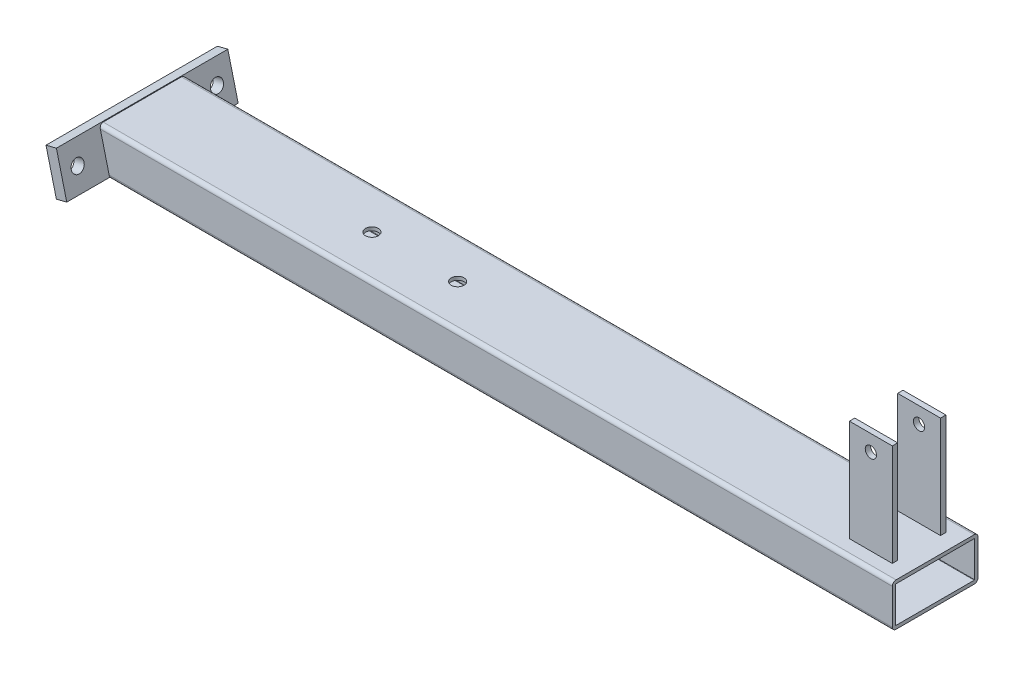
ISO-10303-21;
HEADER;
FILE_DESCRIPTION(('STEP AP214'),'2;1');
FILE_NAME('part.step','',(''),(''),'','','');
FILE_SCHEMA(('AUTOMOTIVE_DESIGN { 1 0 10303 214 1 1 1 1 }'));
ENDSEC;
DATA;
#1=APPLICATION_CONTEXT('core data for automotive mechanical design processes');
#2=APPLICATION_PROTOCOL_DEFINITION('international standard','automotive_design',2000,#1);
#3=PRODUCT_CONTEXT('',#1,'mechanical');
#4=PRODUCT('Part','Part','',(#3));
#5=PRODUCT_RELATED_PRODUCT_CATEGORY('part','',(#4));
#6=PRODUCT_DEFINITION_FORMATION('','',#4);
#7=PRODUCT_DEFINITION_CONTEXT('part definition',#1,'design');
#8=PRODUCT_DEFINITION('design','',#6,#7);
#9=PRODUCT_DEFINITION_SHAPE('','',#8);
#10=(LENGTH_UNIT() NAMED_UNIT(*) SI_UNIT(.MILLI.,.METRE.));
#11=(NAMED_UNIT(*) PLANE_ANGLE_UNIT() SI_UNIT($,.RADIAN.));
#12=(NAMED_UNIT(*) SI_UNIT($,.STERADIAN.) SOLID_ANGLE_UNIT());
#13=UNCERTAINTY_MEASURE_WITH_UNIT(LENGTH_MEASURE(1.E-05),#10,'distance_accuracy_value','');
#14=(GEOMETRIC_REPRESENTATION_CONTEXT(3) GLOBAL_UNCERTAINTY_ASSIGNED_CONTEXT((#13)) GLOBAL_UNIT_ASSIGNED_CONTEXT((#10,
#11,#12)) REPRESENTATION_CONTEXT('',''));
#15=CARTESIAN_POINT('',(0.,0.,0.));
#16=DIRECTION('',(0.,0.,1.));
#17=DIRECTION('',(1.,0.,0.));
#18=AXIS2_PLACEMENT_3D('',#15,#16,#17);
#19=CARTESIAN_POINT('',(-55.,115.,24.9999999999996));
#20=DIRECTION('',(0.,0.,-1.));
#21=DIRECTION('',(0.,1.,0.));
#22=AXIS2_PLACEMENT_3D('',#19,#20,#21);
#23=PLANE('',#22);
#24=CARTESIAN_POINT('',(-35.,99.9999999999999,24.9999999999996));
#25=DIRECTION('',(0.,0.,-1.));
#26=DIRECTION('',(0.,1.,0.));
#27=AXIS2_PLACEMENT_3D('',#24,#25,#26);
#28=CIRCLE('',#27,5.25);
#29=CARTESIAN_POINT('',(-35.,105.25,24.9999999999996));
#30=VERTEX_POINT('',#29);
#31=EDGE_CURVE('E137',#30,#30,#28,.T.);
#32=ORIENTED_EDGE('',*,*,#31,.T.);
#33=EDGE_LOOP('',(#32));
#34=FACE_BOUND('',#33,.T.);
#35=DIRECTION('',(1.,0.,0.));
#36=VECTOR('',#35,1.);
#37=CARTESIAN_POINT('',(-55.,20.0000000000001,24.9999999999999));
#38=LINE('',#37,#36);
#39=CARTESIAN_POINT('',(-55.,20.0000000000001,24.9999999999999));
#40=VERTEX_POINT('',#39);
#41=CARTESIAN_POINT('',(-15.,20.0000000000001,24.9999999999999));
#42=VERTEX_POINT('',#41);
#43=EDGE_CURVE('E134',#40,#42,#38,.T.);
#44=ORIENTED_EDGE('',*,*,#43,.T.);
#45=DIRECTION('',(0.,-1.,0.));
#46=VECTOR('',#45,1.);
#47=CARTESIAN_POINT('',(-15.,115.,24.9999999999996));
#48=LINE('',#47,#46);
#49=CARTESIAN_POINT('',(-15.,115.,24.9999999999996));
#50=VERTEX_POINT('',#49);
#51=EDGE_CURVE('E13',#50,#42,#48,.T.);
#52=ORIENTED_EDGE('',*,*,#51,.F.);
#53=DIRECTION('',(1.,0.,0.));
#54=VECTOR('',#53,1.);
#55=CARTESIAN_POINT('',(-55.,115.,24.9999999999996));
#56=LINE('',#55,#54);
#57=CARTESIAN_POINT('',(-55.,115.,24.9999999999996));
#58=VERTEX_POINT('',#57);
#59=EDGE_CURVE('E121',#58,#50,#56,.T.);
#60=ORIENTED_EDGE('',*,*,#59,.F.);
#61=DIRECTION('',(0.,-1.,0.));
#62=VECTOR('',#61,1.);
#63=CARTESIAN_POINT('',(-55.,115.,24.9999999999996));
#64=LINE('',#63,#62);
#65=EDGE_CURVE('E130',#58,#40,#64,.T.);
#66=ORIENTED_EDGE('',*,*,#65,.T.);
#67=EDGE_LOOP('',(#44,#52,#60,#66));
#68=FACE_BOUND('',#67,.T.);
#69=ADVANCED_FACE('F69',(#34,#68),#23,.F.);
#70=CARTESIAN_POINT('',(-15.,115.,24.9999999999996));
#71=DIRECTION('',(-1.,0.,0.));
#72=DIRECTION('',(0.,0.,1.));
#73=AXIS2_PLACEMENT_3D('',#70,#71,#72);
#74=PLANE('',#73);
#75=DIRECTION('',(0.,0.,-1.));
#76=VECTOR('',#75,1.);
#77=CARTESIAN_POINT('',(-15.,20.0000000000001,24.9999999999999));
#78=LINE('',#77,#76);
#79=CARTESIAN_POINT('',(-15.,20.0000000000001,19.9999999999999));
#80=VERTEX_POINT('',#79);
#81=EDGE_CURVE('E125',#42,#80,#78,.T.);
#82=ORIENTED_EDGE('',*,*,#81,.T.);
#83=DIRECTION('',(0.,-1.,0.));
#84=VECTOR('',#83,1.);
#85=CARTESIAN_POINT('',(-15.,115.,19.9999999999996));
#86=LINE('',#85,#84);
#87=CARTESIAN_POINT('',(-15.,115.,19.9999999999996));
#88=VERTEX_POINT('',#87);
#89=EDGE_CURVE('E78',#88,#80,#86,.T.);
#90=ORIENTED_EDGE('',*,*,#89,.F.);
#91=DIRECTION('',(0.,0.,-1.));
#92=VECTOR('',#91,1.);
#93=CARTESIAN_POINT('',(-15.,115.,24.9999999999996));
#94=LINE('',#93,#92);
#95=EDGE_CURVE('E116',#50,#88,#94,.T.);
#96=ORIENTED_EDGE('',*,*,#95,.F.);
#97=ORIENTED_EDGE('',*,*,#51,.T.);
#98=EDGE_LOOP('',(#82,#90,#96,#97));
#99=FACE_BOUND('',#98,.T.);
#100=ADVANCED_FACE('F124',(#99),#74,.F.);
#101=CARTESIAN_POINT('',(-55.,115.,19.9999999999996));
#102=DIRECTION('',(0.,0.,1.));
#103=DIRECTION('',(0.,-1.,0.));
#104=AXIS2_PLACEMENT_3D('',#101,#102,#103);
#105=PLANE('',#104);
#106=CARTESIAN_POINT('',(-35.,99.9999999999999,19.9999999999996));
#107=DIRECTION('',(0.,0.,1.));
#108=DIRECTION('',(0.,-1.,0.));
#109=AXIS2_PLACEMENT_3D('',#106,#107,#108);
#110=CIRCLE('',#109,5.25);
#111=CARTESIAN_POINT('',(-35.,94.7499999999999,19.9999999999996));
#112=VERTEX_POINT('',#111);
#113=EDGE_CURVE('E72',#112,#112,#110,.T.);
#114=ORIENTED_EDGE('',*,*,#113,.T.);
#115=EDGE_LOOP('',(#114));
#116=FACE_BOUND('',#115,.T.);
#117=DIRECTION('',(-1.,0.,0.));
#118=VECTOR('',#117,1.);
#119=CARTESIAN_POINT('',(-55.,20.0000000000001,19.9999999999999));
#120=LINE('',#119,#118);
#121=CARTESIAN_POINT('',(-55.,20.0000000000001,19.9999999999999));
#122=VERTEX_POINT('',#121);
#123=EDGE_CURVE('E103',#80,#122,#120,.T.);
#124=ORIENTED_EDGE('',*,*,#123,.T.);
#125=DIRECTION('',(0.,-1.,0.));
#126=VECTOR('',#125,1.);
#127=CARTESIAN_POINT('',(-55.,115.,19.9999999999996));
#128=LINE('',#127,#126);
#129=CARTESIAN_POINT('',(-55.,115.,19.9999999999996));
#130=VERTEX_POINT('',#129);
#131=EDGE_CURVE('E126',#130,#122,#128,.T.);
#132=ORIENTED_EDGE('',*,*,#131,.F.);
#133=DIRECTION('',(-1.,0.,0.));
#134=VECTOR('',#133,1.);
#135=CARTESIAN_POINT('',(-55.,115.,19.9999999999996));
#136=LINE('',#135,#134);
#137=EDGE_CURVE('E119',#88,#130,#136,.T.);
#138=ORIENTED_EDGE('',*,*,#137,.F.);
#139=ORIENTED_EDGE('',*,*,#89,.T.);
#140=EDGE_LOOP('',(#124,#132,#138,#139));
#141=FACE_BOUND('',#140,.T.);
#142=ADVANCED_FACE('F128',(#116,#141),#105,.F.);
#143=CARTESIAN_POINT('',(-55.,115.,24.9999999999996));
#144=DIRECTION('',(1.,0.,0.));
#145=DIRECTION('',(0.,0.,-1.));
#146=AXIS2_PLACEMENT_3D('',#143,#144,#145);
#147=PLANE('',#146);
#148=DIRECTION('',(0.,0.,1.));
#149=VECTOR('',#148,1.);
#150=CARTESIAN_POINT('',(-55.,20.0000000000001,24.9999999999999));
#151=LINE('',#150,#149);
#152=EDGE_CURVE('E109',#122,#40,#151,.T.);
#153=ORIENTED_EDGE('',*,*,#152,.T.);
#154=ORIENTED_EDGE('',*,*,#65,.F.);
#155=DIRECTION('',(0.,0.,1.));
#156=VECTOR('',#155,1.);
#157=CARTESIAN_POINT('',(-55.,115.,24.9999999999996));
#158=LINE('',#157,#156);
#159=EDGE_CURVE('E86',#130,#58,#158,.T.);
#160=ORIENTED_EDGE('',*,*,#159,.F.);
#161=ORIENTED_EDGE('',*,*,#131,.T.);
#162=EDGE_LOOP('',(#153,#154,#160,#161));
#163=FACE_BOUND('',#162,.T.);
#164=ADVANCED_FACE('F142',(#163),#147,.F.);
#165=CARTESIAN_POINT('',(-15.,115.,24.9999999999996));
#166=DIRECTION('',(0.,1.,0.));
#167=DIRECTION('',(0.,0.,1.));
#168=AXIS2_PLACEMENT_3D('',#165,#166,#167);
#169=PLANE('',#168);
#170=ORIENTED_EDGE('',*,*,#59,.T.);
#171=ORIENTED_EDGE('',*,*,#95,.T.);
#172=ORIENTED_EDGE('',*,*,#137,.T.);
#173=ORIENTED_EDGE('',*,*,#159,.T.);
#174=EDGE_LOOP('',(#170,#171,#172,#173));
#175=FACE_BOUND('',#174,.T.);
#176=ADVANCED_FACE('F117',(#175),#169,.T.);
#177=CARTESIAN_POINT('',(-15.,20.0000000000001,24.9999999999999));
#178=DIRECTION('',(0.,1.,0.));
#179=DIRECTION('',(0.,0.,1.));
#180=AXIS2_PLACEMENT_3D('',#177,#178,#179);
#181=PLANE('',#180);
#182=ORIENTED_EDGE('',*,*,#43,.F.);
#183=ORIENTED_EDGE('',*,*,#152,.F.);
#184=ORIENTED_EDGE('',*,*,#123,.F.);
#185=ORIENTED_EDGE('',*,*,#81,.F.);
#186=EDGE_LOOP('',(#182,#183,#184,#185));
#187=FACE_BOUND('',#186,.T.);
#188=ADVANCED_FACE('F145',(#187),#181,.F.);
#189=CARTESIAN_POINT('',(-35.,99.9999999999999,-80.));
#190=DIRECTION('',(0.,0.,1.));
#191=DIRECTION('',(1.,0.,0.));
#192=AXIS2_PLACEMENT_3D('',#189,#190,#191);
#193=CYLINDRICAL_SURFACE('',#192,5.25);
#194=ORIENTED_EDGE('',*,*,#113,.F.);
#195=EDGE_LOOP('',(#194));
#196=FACE_BOUND('',#195,.T.);
#197=ORIENTED_EDGE('',*,*,#31,.F.);
#198=EDGE_LOOP('',(#197));
#199=FACE_BOUND('',#198,.T.);
#200=ADVANCED_FACE('F155',(#196,#199),#193,.F.);
#201=CLOSED_SHELL('',(#69,#100,#142,#164,#176,#188,#200));
#202=MANIFOLD_SOLID_BREP('B2',#201);
#203=CARTESIAN_POINT('',(-55.,115.,-25.0000000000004));
#204=DIRECTION('',(1.,0.,0.));
#205=DIRECTION('',(0.,0.,-1.));
#206=AXIS2_PLACEMENT_3D('',#203,#204,#205);
#207=PLANE('',#206);
#208=DIRECTION('',(0.,0.,1.));
#209=VECTOR('',#208,1.);
#210=CARTESIAN_POINT('',(-55.,19.9999999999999,-25.));
#211=LINE('',#210,#209);
#212=CARTESIAN_POINT('',(-55.,19.9999999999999,-25.));
#213=VERTEX_POINT('',#212);
#214=CARTESIAN_POINT('',(-55.,19.9999999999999,-20.));
#215=VERTEX_POINT('',#214);
#216=EDGE_CURVE('E288',#213,#215,#211,.T.);
#217=ORIENTED_EDGE('',*,*,#216,.T.);
#218=DIRECTION('',(0.,-1.,0.));
#219=VECTOR('',#218,1.);
#220=CARTESIAN_POINT('',(-55.,115.,-20.0000000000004));
#221=LINE('',#220,#219);
#222=CARTESIAN_POINT('',(-55.,115.,-20.0000000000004));
#223=VERTEX_POINT('',#222);
#224=EDGE_CURVE('E67',#223,#215,#221,.T.);
#225=ORIENTED_EDGE('',*,*,#224,.F.);
#226=DIRECTION('',(0.,0.,1.));
#227=VECTOR('',#226,1.);
#228=CARTESIAN_POINT('',(-55.,115.,-25.0000000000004));
#229=LINE('',#228,#227);
#230=CARTESIAN_POINT('',(-55.,115.,-25.0000000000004));
#231=VERTEX_POINT('',#230);
#232=EDGE_CURVE('E275',#231,#223,#229,.T.);
#233=ORIENTED_EDGE('',*,*,#232,.F.);
#234=DIRECTION('',(0.,-1.,0.));
#235=VECTOR('',#234,1.);
#236=CARTESIAN_POINT('',(-55.,115.,-25.0000000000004));
#237=LINE('',#236,#235);
#238=EDGE_CURVE('E284',#231,#213,#237,.T.);
#239=ORIENTED_EDGE('',*,*,#238,.T.);
#240=EDGE_LOOP('',(#217,#225,#233,#239));
#241=FACE_BOUND('',#240,.T.);
#242=ADVANCED_FACE('F223',(#241),#207,.F.);
#243=CARTESIAN_POINT('',(-55.,115.,-20.0000000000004));
#244=DIRECTION('',(0.,0.,-1.));
#245=DIRECTION('',(0.,1.,0.));
#246=AXIS2_PLACEMENT_3D('',#243,#244,#245);
#247=PLANE('',#246);
#248=CARTESIAN_POINT('',(-35.,99.9999999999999,-20.0000000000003));
#249=DIRECTION('',(0.,0.,-1.));
#250=DIRECTION('',(0.,1.,0.));
#251=AXIS2_PLACEMENT_3D('',#248,#249,#250);
#252=CIRCLE('',#251,5.25);
#253=CARTESIAN_POINT('',(-35.,105.25,-20.0000000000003));
#254=VERTEX_POINT('',#253);
#255=EDGE_CURVE('E291',#254,#254,#252,.T.);
#256=ORIENTED_EDGE('',*,*,#255,.T.);
#257=EDGE_LOOP('',(#256));
#258=FACE_BOUND('',#257,.T.);
#259=DIRECTION('',(1.,0.,0.));
#260=VECTOR('',#259,1.);
#261=CARTESIAN_POINT('',(-55.,19.9999999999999,-20.));
#262=LINE('',#261,#260);
#263=CARTESIAN_POINT('',(-15.,19.9999999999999,-20.));
#264=VERTEX_POINT('',#263);
#265=EDGE_CURVE('E279',#215,#264,#262,.T.);
#266=ORIENTED_EDGE('',*,*,#265,.T.);
#267=DIRECTION('',(0.,-1.,0.));
#268=VECTOR('',#267,1.);
#269=CARTESIAN_POINT('',(-15.,115.,-20.0000000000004));
#270=LINE('',#269,#268);
#271=CARTESIAN_POINT('',(-15.,115.,-20.0000000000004));
#272=VERTEX_POINT('',#271);
#273=EDGE_CURVE('E232',#272,#264,#270,.T.);
#274=ORIENTED_EDGE('',*,*,#273,.F.);
#275=DIRECTION('',(1.,0.,0.));
#276=VECTOR('',#275,1.);
#277=CARTESIAN_POINT('',(-55.,115.,-20.0000000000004));
#278=LINE('',#277,#276);
#279=EDGE_CURVE('E270',#223,#272,#278,.T.);
#280=ORIENTED_EDGE('',*,*,#279,.F.);
#281=ORIENTED_EDGE('',*,*,#224,.T.);
#282=EDGE_LOOP('',(#266,#274,#280,#281));
#283=FACE_BOUND('',#282,.T.);
#284=ADVANCED_FACE('F278',(#258,#283),#247,.F.);
#285=CARTESIAN_POINT('',(-15.,115.,-25.0000000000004));
#286=DIRECTION('',(-1.,0.,0.));
#287=DIRECTION('',(0.,0.,1.));
#288=AXIS2_PLACEMENT_3D('',#285,#286,#287);
#289=PLANE('',#288);
#290=DIRECTION('',(0.,0.,-1.));
#291=VECTOR('',#290,1.);
#292=CARTESIAN_POINT('',(-15.,19.9999999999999,-25.));
#293=LINE('',#292,#291);
#294=CARTESIAN_POINT('',(-15.,19.9999999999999,-25.));
#295=VERTEX_POINT('',#294);
#296=EDGE_CURVE('E257',#264,#295,#293,.T.);
#297=ORIENTED_EDGE('',*,*,#296,.T.);
#298=DIRECTION('',(0.,-1.,0.));
#299=VECTOR('',#298,1.);
#300=CARTESIAN_POINT('',(-15.,115.,-25.0000000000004));
#301=LINE('',#300,#299);
#302=CARTESIAN_POINT('',(-15.,115.,-25.0000000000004));
#303=VERTEX_POINT('',#302);
#304=EDGE_CURVE('E280',#303,#295,#301,.T.);
#305=ORIENTED_EDGE('',*,*,#304,.F.);
#306=DIRECTION('',(0.,0.,-1.));
#307=VECTOR('',#306,1.);
#308=CARTESIAN_POINT('',(-15.,115.,-25.0000000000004));
#309=LINE('',#308,#307);
#310=EDGE_CURVE('E273',#272,#303,#309,.T.);
#311=ORIENTED_EDGE('',*,*,#310,.F.);
#312=ORIENTED_EDGE('',*,*,#273,.T.);
#313=EDGE_LOOP('',(#297,#305,#311,#312));
#314=FACE_BOUND('',#313,.T.);
#315=ADVANCED_FACE('F282',(#314),#289,.F.);
#316=CARTESIAN_POINT('',(-55.,115.,-25.0000000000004));
#317=DIRECTION('',(0.,0.,1.));
#318=DIRECTION('',(0.,-1.,0.));
#319=AXIS2_PLACEMENT_3D('',#316,#317,#318);
#320=PLANE('',#319);
#321=CARTESIAN_POINT('',(-35.,99.9999999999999,-25.0000000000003));
#322=DIRECTION('',(0.,0.,1.));
#323=DIRECTION('',(0.,-1.,0.));
#324=AXIS2_PLACEMENT_3D('',#321,#322,#323);
#325=CIRCLE('',#324,5.25);
#326=CARTESIAN_POINT('',(-35.,94.7499999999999,-25.0000000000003));
#327=VERTEX_POINT('',#326);
#328=EDGE_CURVE('E226',#327,#327,#325,.T.);
#329=ORIENTED_EDGE('',*,*,#328,.T.);
#330=EDGE_LOOP('',(#329));
#331=FACE_BOUND('',#330,.T.);
#332=DIRECTION('',(-1.,0.,0.));
#333=VECTOR('',#332,1.);
#334=CARTESIAN_POINT('',(-55.,19.9999999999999,-25.));
#335=LINE('',#334,#333);
#336=EDGE_CURVE('E263',#295,#213,#335,.T.);
#337=ORIENTED_EDGE('',*,*,#336,.T.);
#338=ORIENTED_EDGE('',*,*,#238,.F.);
#339=DIRECTION('',(-1.,0.,0.));
#340=VECTOR('',#339,1.);
#341=CARTESIAN_POINT('',(-55.,115.,-25.0000000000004));
#342=LINE('',#341,#340);
#343=EDGE_CURVE('E240',#303,#231,#342,.T.);
#344=ORIENTED_EDGE('',*,*,#343,.F.);
#345=ORIENTED_EDGE('',*,*,#304,.T.);
#346=EDGE_LOOP('',(#337,#338,#344,#345));
#347=FACE_BOUND('',#346,.T.);
#348=ADVANCED_FACE('F296',(#331,#347),#320,.F.);
#349=CARTESIAN_POINT('',(-55.,115.,-20.0000000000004));
#350=DIRECTION('',(0.,1.,0.));
#351=DIRECTION('',(0.,0.,1.));
#352=AXIS2_PLACEMENT_3D('',#349,#350,#351);
#353=PLANE('',#352);
#354=ORIENTED_EDGE('',*,*,#232,.T.);
#355=ORIENTED_EDGE('',*,*,#279,.T.);
#356=ORIENTED_EDGE('',*,*,#310,.T.);
#357=ORIENTED_EDGE('',*,*,#343,.T.);
#358=EDGE_LOOP('',(#354,#355,#356,#357));
#359=FACE_BOUND('',#358,.T.);
#360=ADVANCED_FACE('F271',(#359),#353,.T.);
#361=CARTESIAN_POINT('',(-55.,19.9999999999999,-20.));
#362=DIRECTION('',(0.,1.,0.));
#363=DIRECTION('',(0.,0.,1.));
#364=AXIS2_PLACEMENT_3D('',#361,#362,#363);
#365=PLANE('',#364);
#366=ORIENTED_EDGE('',*,*,#216,.F.);
#367=ORIENTED_EDGE('',*,*,#336,.F.);
#368=ORIENTED_EDGE('',*,*,#296,.F.);
#369=ORIENTED_EDGE('',*,*,#265,.F.);
#370=EDGE_LOOP('',(#366,#367,#368,#369));
#371=FACE_BOUND('',#370,.T.);
#372=ADVANCED_FACE('F299',(#371),#365,.F.);
#373=CARTESIAN_POINT('',(-35.,99.9999999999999,-80.));
#374=DIRECTION('',(0.,0.,1.));
#375=DIRECTION('',(1.,0.,0.));
#376=AXIS2_PLACEMENT_3D('',#373,#374,#375);
#377=CYLINDRICAL_SURFACE('',#376,5.25);
#378=ORIENTED_EDGE('',*,*,#328,.F.);
#379=EDGE_LOOP('',(#378));
#380=FACE_BOUND('',#379,.T.);
#381=ORIENTED_EDGE('',*,*,#255,.F.);
#382=EDGE_LOOP('',(#381));
#383=FACE_BOUND('',#382,.T.);
#384=ADVANCED_FACE('F309',(#380,#383),#377,.F.);
#385=CLOSED_SHELL('',(#242,#284,#315,#348,#360,#372,#384));
#386=MANIFOLD_SOLID_BREP('B7',#385);
#387=CARTESIAN_POINT('',(-740.169803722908,-20.6546094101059,-80.));
#388=DIRECTION('',(-0.970295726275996,-0.24192189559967,0.));
#389=DIRECTION('',(0.24192189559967,-0.970295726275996,0.));
#390=AXIS2_PLACEMENT_3D('',#387,#388,#389);
#391=PLANE('',#390);
#392=CARTESIAN_POINT('',(-745.008241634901,-1.24869488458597,-65.));
#393=DIRECTION('',(-0.970295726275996,-0.241921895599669,0.));
#394=DIRECTION('',(0.241921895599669,-0.970295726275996,0.));
#395=AXIS2_PLACEMENT_3D('',#392,#393,#394);
#396=CIRCLE('',#395,6.);
#397=CARTESIAN_POINT('',(-743.556710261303,-7.07046924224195,-65.));
#398=VERTEX_POINT('',#397);
#399=EDGE_CURVE('E443',#398,#398,#396,.T.);
#400=ORIENTED_EDGE('',*,*,#399,.F.);
#401=EDGE_LOOP('',(#400));
#402=FACE_BOUND('',#401,.T.);
#403=DIRECTION('',(0.24192189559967,-0.970295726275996,0.));
#404=VECTOR('',#403,1.);
#405=CARTESIAN_POINT('',(-749.846679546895,18.1572196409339,-80.));
#406=LINE('',#405,#404);
#407=CARTESIAN_POINT('',(-749.846679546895,18.1572196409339,-80.));
#408=VERTEX_POINT('',#407);
#409=CARTESIAN_POINT('',(-740.169803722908,-20.6546094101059,-80.));
#410=VERTEX_POINT('',#409);
#411=EDGE_CURVE('E428',#408,#410,#406,.T.);
#412=ORIENTED_EDGE('',*,*,#411,.T.);
#413=DIRECTION('',(0.,0.,1.));
#414=VECTOR('',#413,1.);
#415=CARTESIAN_POINT('',(-740.169803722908,-20.6546094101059,-80.));
#416=LINE('',#415,#414);
#417=CARTESIAN_POINT('',(-740.169803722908,-20.6546094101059,80.));
#418=VERTEX_POINT('',#417);
#419=EDGE_CURVE('E423',#410,#418,#416,.T.);
#420=ORIENTED_EDGE('',*,*,#419,.T.);
#421=DIRECTION('',(-0.24192189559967,0.970295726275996,0.));
#422=VECTOR('',#421,1.);
#423=CARTESIAN_POINT('',(-749.846679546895,18.157219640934,80.));
#424=LINE('',#423,#422);
#425=CARTESIAN_POINT('',(-749.846679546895,18.157219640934,80.));
#426=VERTEX_POINT('',#425);
#427=EDGE_CURVE('E426',#418,#426,#424,.T.);
#428=ORIENTED_EDGE('',*,*,#427,.T.);
#429=DIRECTION('',(0.,0.,-1.));
#430=VECTOR('',#429,1.);
#431=CARTESIAN_POINT('',(-749.846679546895,18.1572196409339,-80.));
#432=LINE('',#431,#430);
#433=EDGE_CURVE('E393',#426,#408,#432,.T.);
#434=ORIENTED_EDGE('',*,*,#433,.T.);
#435=EDGE_LOOP('',(#412,#420,#428,#434));
#436=FACE_BOUND('',#435,.T.);
#437=CARTESIAN_POINT('',(-745.008241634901,-1.24869488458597,65.));
#438=DIRECTION('',(-0.970295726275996,-0.241921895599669,0.));
#439=DIRECTION('',(0.241921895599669,-0.970295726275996,0.));
#440=AXIS2_PLACEMENT_3D('',#437,#438,#439);
#441=CIRCLE('',#440,6.00000000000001);
#442=CARTESIAN_POINT('',(-743.556710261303,-7.07046924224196,65.));
#443=VERTEX_POINT('',#442);
#444=EDGE_CURVE('E458',#443,#443,#441,.T.);
#445=ORIENTED_EDGE('',*,*,#444,.F.);
#446=EDGE_LOOP('',(#445));
#447=FACE_BOUND('',#446,.T.);
#448=ADVANCED_FACE('F376',(#402,#436,#447),#391,.T.);
#449=CARTESIAN_POINT('',(-730.466846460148,-18.2353904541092,-80.));
#450=DIRECTION('',(-0.970295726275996,-0.24192189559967,0.));
#451=DIRECTION('',(0.24192189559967,-0.970295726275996,0.));
#452=AXIS2_PLACEMENT_3D('',#449,#450,#451);
#453=PLANE('',#452);
#454=CARTESIAN_POINT('',(-735.305284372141,1.17052407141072,-65.));
#455=DIRECTION('',(-0.970295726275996,-0.241921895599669,0.));
#456=DIRECTION('',(0.241921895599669,-0.970295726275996,0.));
#457=AXIS2_PLACEMENT_3D('',#454,#455,#456);
#458=CIRCLE('',#457,6.);
#459=CARTESIAN_POINT('',(-733.853752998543,-4.65125028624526,-65.));
#460=VERTEX_POINT('',#459);
#461=EDGE_CURVE('E455',#460,#460,#458,.T.);
#462=ORIENTED_EDGE('',*,*,#461,.T.);
#463=EDGE_LOOP('',(#462));
#464=FACE_BOUND('',#463,.T.);
#465=DIRECTION('',(0.24192189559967,-0.970295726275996,0.));
#466=VECTOR('',#465,1.);
#467=CARTESIAN_POINT('',(-740.143722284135,20.5764385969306,-80.));
#468=LINE('',#467,#466);
#469=CARTESIAN_POINT('',(-740.143722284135,20.5764385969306,-80.));
#470=VERTEX_POINT('',#469);
#471=CARTESIAN_POINT('',(-730.466846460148,-18.2353904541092,-80.));
#472=VERTEX_POINT('',#471);
#473=EDGE_CURVE('E440',#470,#472,#468,.T.);
#474=ORIENTED_EDGE('',*,*,#473,.F.);
#475=DIRECTION('',(0.,0.,-1.));
#476=VECTOR('',#475,1.);
#477=CARTESIAN_POINT('',(-740.143722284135,20.5764385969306,-80.));
#478=LINE('',#477,#476);
#479=CARTESIAN_POINT('',(-740.143722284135,20.5764385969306,80.));
#480=VERTEX_POINT('',#479);
#481=EDGE_CURVE('E416',#480,#470,#478,.T.);
#482=ORIENTED_EDGE('',*,*,#481,.F.);
#483=DIRECTION('',(-0.24192189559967,0.970295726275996,0.));
#484=VECTOR('',#483,1.);
#485=CARTESIAN_POINT('',(-740.143722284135,20.5764385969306,80.));
#486=LINE('',#485,#484);
#487=CARTESIAN_POINT('',(-730.466846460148,-18.2353904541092,80.));
#488=VERTEX_POINT('',#487);
#489=EDGE_CURVE('E410',#488,#480,#486,.T.);
#490=ORIENTED_EDGE('',*,*,#489,.F.);
#491=DIRECTION('',(0.,0.,1.));
#492=VECTOR('',#491,1.);
#493=CARTESIAN_POINT('',(-730.466846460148,-18.2353904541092,-80.));
#494=LINE('',#493,#492);
#495=EDGE_CURVE('E432',#472,#488,#494,.T.);
#496=ORIENTED_EDGE('',*,*,#495,.F.);
#497=EDGE_LOOP('',(#474,#482,#490,#496));
#498=FACE_BOUND('',#497,.T.);
#499=CARTESIAN_POINT('',(-735.305284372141,1.17052407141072,65.));
#500=DIRECTION('',(-0.970295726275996,-0.241921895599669,0.));
#501=DIRECTION('',(0.241921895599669,-0.970295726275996,0.));
#502=AXIS2_PLACEMENT_3D('',#499,#500,#501);
#503=CIRCLE('',#502,6.00000000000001);
#504=CARTESIAN_POINT('',(-733.853752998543,-4.65125028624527,65.));
#505=VERTEX_POINT('',#504);
#506=EDGE_CURVE('E461',#505,#505,#503,.T.);
#507=ORIENTED_EDGE('',*,*,#506,.T.);
#508=EDGE_LOOP('',(#507));
#509=FACE_BOUND('',#508,.T.);
#510=ADVANCED_FACE('F451',(#464,#498,#509),#453,.F.);
#511=CARTESIAN_POINT('',(-749.846679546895,18.1572196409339,-80.));
#512=DIRECTION('',(0.,0.,1.));
#513=DIRECTION('',(1.,0.,0.));
#514=AXIS2_PLACEMENT_3D('',#511,#512,#513);
#515=PLANE('',#514);
#516=ORIENTED_EDGE('',*,*,#473,.T.);
#517=DIRECTION('',(0.970295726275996,0.241921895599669,0.));
#518=VECTOR('',#517,1.);
#519=CARTESIAN_POINT('',(-740.169803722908,-20.6546094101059,-80.));
#520=LINE('',#519,#518);
#521=EDGE_CURVE('E221',#410,#472,#520,.T.);
#522=ORIENTED_EDGE('',*,*,#521,.F.);
#523=ORIENTED_EDGE('',*,*,#411,.F.);
#524=DIRECTION('',(0.970295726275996,0.241921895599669,0.));
#525=VECTOR('',#524,1.);
#526=CARTESIAN_POINT('',(-749.846679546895,18.1572196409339,-80.));
#527=LINE('',#526,#525);
#528=EDGE_CURVE('E436',#408,#470,#527,.T.);
#529=ORIENTED_EDGE('',*,*,#528,.T.);
#530=EDGE_LOOP('',(#516,#522,#523,#529));
#531=FACE_BOUND('',#530,.T.);
#532=ADVANCED_FACE('F378',(#531),#515,.F.);
#533=CARTESIAN_POINT('',(-740.169803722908,-20.6546094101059,-80.));
#534=DIRECTION('',(-0.241921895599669,0.970295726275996,0.));
#535=DIRECTION('',(-0.970295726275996,-0.241921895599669,0.));
#536=AXIS2_PLACEMENT_3D('',#533,#534,#535);
#537=PLANE('',#536);
#538=ORIENTED_EDGE('',*,*,#495,.T.);
#539=DIRECTION('',(0.970295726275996,0.241921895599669,0.));
#540=VECTOR('',#539,1.);
#541=CARTESIAN_POINT('',(-740.169803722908,-20.6546094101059,80.));
#542=LINE('',#541,#540);
#543=EDGE_CURVE('E385',#418,#488,#542,.T.);
#544=ORIENTED_EDGE('',*,*,#543,.F.);
#545=ORIENTED_EDGE('',*,*,#419,.F.);
#546=ORIENTED_EDGE('',*,*,#521,.T.);
#547=EDGE_LOOP('',(#538,#544,#545,#546));
#548=FACE_BOUND('',#547,.T.);
#549=ADVANCED_FACE('F431',(#548),#537,.F.);
#550=CARTESIAN_POINT('',(-749.846679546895,18.157219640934,80.));
#551=DIRECTION('',(0.,0.,-1.));
#552=DIRECTION('',(-1.,0.,0.));
#553=AXIS2_PLACEMENT_3D('',#550,#551,#552);
#554=PLANE('',#553);
#555=ORIENTED_EDGE('',*,*,#489,.T.);
#556=DIRECTION('',(0.970295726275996,0.241921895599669,0.));
#557=VECTOR('',#556,1.);
#558=CARTESIAN_POINT('',(-749.846679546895,18.157219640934,80.));
#559=LINE('',#558,#557);
#560=EDGE_CURVE('E433',#426,#480,#559,.T.);
#561=ORIENTED_EDGE('',*,*,#560,.F.);
#562=ORIENTED_EDGE('',*,*,#427,.F.);
#563=ORIENTED_EDGE('',*,*,#543,.T.);
#564=EDGE_LOOP('',(#555,#561,#562,#563));
#565=FACE_BOUND('',#564,.T.);
#566=ADVANCED_FACE('F434',(#565),#554,.F.);
#567=CARTESIAN_POINT('',(-749.846679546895,18.1572196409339,-80.));
#568=DIRECTION('',(0.241921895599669,-0.970295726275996,0.));
#569=DIRECTION('',(0.970295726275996,0.241921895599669,0.));
#570=AXIS2_PLACEMENT_3D('',#567,#568,#569);
#571=PLANE('',#570);
#572=ORIENTED_EDGE('',*,*,#481,.T.);
#573=ORIENTED_EDGE('',*,*,#528,.F.);
#574=ORIENTED_EDGE('',*,*,#433,.F.);
#575=ORIENTED_EDGE('',*,*,#560,.T.);
#576=EDGE_LOOP('',(#572,#573,#574,#575));
#577=FACE_BOUND('',#576,.T.);
#578=ADVANCED_FACE('F448',(#577),#571,.F.);
#579=CARTESIAN_POINT('',(-745.008241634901,-1.24869488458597,-65.));
#580=DIRECTION('',(0.970295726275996,0.241921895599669,0.));
#581=DIRECTION('',(-0.241921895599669,0.970295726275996,0.));
#582=AXIS2_PLACEMENT_3D('',#579,#580,#581);
#583=CYLINDRICAL_SURFACE('',#582,6.);
#584=ORIENTED_EDGE('',*,*,#399,.T.);
#585=EDGE_LOOP('',(#584));
#586=FACE_BOUND('',#585,.T.);
#587=ORIENTED_EDGE('',*,*,#461,.F.);
#588=EDGE_LOOP('',(#587));
#589=FACE_BOUND('',#588,.T.);
#590=ADVANCED_FACE('F479',(#586,#589),#583,.F.);
#591=CARTESIAN_POINT('',(-745.008241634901,-1.24869488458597,65.));
#592=DIRECTION('',(0.970295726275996,0.241921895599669,0.));
#593=DIRECTION('',(-0.241921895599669,0.970295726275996,0.));
#594=AXIS2_PLACEMENT_3D('',#591,#592,#593);
#595=CYLINDRICAL_SURFACE('',#594,6.00000000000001);
#596=ORIENTED_EDGE('',*,*,#444,.T.);
#597=EDGE_LOOP('',(#596));
#598=FACE_BOUND('',#597,.T.);
#599=ORIENTED_EDGE('',*,*,#506,.F.);
#600=EDGE_LOOP('',(#599));
#601=FACE_BOUND('',#600,.T.);
#602=ADVANCED_FACE('F467',(#598,#601),#595,.F.);
#603=CLOSED_SHELL('',(#448,#510,#532,#549,#566,#578,#590,#602));
#604=MANIFOLD_SOLID_BREP('B61',#603);
#605=CARTESIAN_POINT('',(-740.,16.4999999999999,-36.5));
#606=DIRECTION('',(1.,0.,0.));
#607=DIRECTION('',(0.,0.,-1.));
#608=AXIS2_PLACEMENT_3D('',#605,#606,#607);
#609=CYLINDRICAL_SURFACE('',#608,3.49999999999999);
#610=CARTESIAN_POINT('',(-739.127351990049,16.4999999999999,-36.5));
#611=DIRECTION('',(-0.970295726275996,-0.241921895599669,0.));
#612=DIRECTION('',(0.241921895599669,-0.970295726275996,0.));
#613=AXIS2_PLACEMENT_3D('',#610,#611,#612);
#614=ELLIPSE('',#613,3.60714770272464,3.49999999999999);
#615=CARTESIAN_POINT('',(-740.,19.9999999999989,-36.5000000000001));
#616=VERTEX_POINT('',#615);
#617=CARTESIAN_POINT('',(-739.127351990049,16.4999999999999,-40.));
#618=VERTEX_POINT('',#617);
#619=EDGE_CURVE('E709',#616,#618,#614,.T.);
#620=ORIENTED_EDGE('',*,*,#619,.F.);
#621=DIRECTION('',(1.,0.,0.));
#622=VECTOR('',#621,1.);
#623=CARTESIAN_POINT('',(-740.,19.9999999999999,-36.5000000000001));
#624=LINE('',#623,#622);
#625=CARTESIAN_POINT('',(0.,19.9999999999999,-36.5000000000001));
#626=VERTEX_POINT('',#625);
#627=EDGE_CURVE('E638',#616,#626,#624,.T.);
#628=ORIENTED_EDGE('',*,*,#627,.T.);
#629=CARTESIAN_POINT('',(0.,16.4999999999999,-36.5));
#630=DIRECTION('',(-1.,0.,0.));
#631=DIRECTION('',(0.,1.,0.));
#632=AXIS2_PLACEMENT_3D('',#629,#630,#631);
#633=CIRCLE('',#632,3.49999999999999);
#634=CARTESIAN_POINT('',(0.,16.4999999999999,-40.));
#635=VERTEX_POINT('',#634);
#636=EDGE_CURVE('E644',#626,#635,#633,.T.);
#637=ORIENTED_EDGE('',*,*,#636,.T.);
#638=DIRECTION('',(1.,0.,0.));
#639=VECTOR('',#638,1.);
#640=CARTESIAN_POINT('',(-740.,16.4999999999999,-40.));
#641=LINE('',#640,#639);
#642=EDGE_CURVE('E374',#618,#635,#641,.T.);
#643=ORIENTED_EDGE('',*,*,#642,.F.);
#644=EDGE_LOOP('',(#620,#628,#637,#643));
#645=FACE_BOUND('',#644,.T.);
#646=ADVANCED_FACE('F541',(#645),#609,.T.);
#647=CARTESIAN_POINT('',(-740.,16.4999999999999,-40.));
#648=DIRECTION('',(0.,0.,1.));
#649=DIRECTION('',(0.,-1.,0.));
#650=AXIS2_PLACEMENT_3D('',#647,#648,#649);
#651=PLANE('',#650);
#652=DIRECTION('',(0.241921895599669,-0.970295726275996,0.));
#653=VECTOR('',#652,1.);
#654=CARTESIAN_POINT('',(-739.178424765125,16.7048417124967,-40.));
#655=LINE('',#654,#653);
#656=CARTESIAN_POINT('',(-730.899527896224,-16.5000000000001,-39.9999999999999));
#657=VERTEX_POINT('',#656);
#658=EDGE_CURVE('E706',#618,#657,#655,.T.);
#659=ORIENTED_EDGE('',*,*,#658,.F.);
#660=ORIENTED_EDGE('',*,*,#642,.T.);
#661=DIRECTION('',(0.,-1.,0.));
#662=VECTOR('',#661,1.);
#663=CARTESIAN_POINT('',(0.,16.4999999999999,-40.));
#664=LINE('',#663,#662);
#665=CARTESIAN_POINT('',(0.,-16.5000000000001,-39.9999999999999));
#666=VERTEX_POINT('',#665);
#667=EDGE_CURVE('E758',#635,#666,#664,.T.);
#668=ORIENTED_EDGE('',*,*,#667,.T.);
#669=DIRECTION('',(1.,0.,0.));
#670=VECTOR('',#669,1.);
#671=CARTESIAN_POINT('',(-740.,-16.5000000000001,-39.9999999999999));
#672=LINE('',#671,#670);
#673=EDGE_CURVE('E550',#657,#666,#672,.T.);
#674=ORIENTED_EDGE('',*,*,#673,.F.);
#675=EDGE_LOOP('',(#659,#660,#668,#674));
#676=FACE_BOUND('',#675,.T.);
#677=ADVANCED_FACE('F869',(#676),#651,.F.);
#678=CARTESIAN_POINT('',(-740.,-16.5000000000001,-36.4999999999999));
#679=DIRECTION('',(1.,0.,0.));
#680=DIRECTION('',(0.,0.,-1.));
#681=AXIS2_PLACEMENT_3D('',#678,#679,#680);
#682=CYLINDRICAL_SURFACE('',#681,3.49999999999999);
#683=CARTESIAN_POINT('',(-730.899527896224,-16.5000000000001,-36.4999999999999));
#684=DIRECTION('',(-0.970295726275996,-0.241921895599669,0.));
#685=DIRECTION('',(0.241921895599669,-0.970295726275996,0.));
#686=AXIS2_PLACEMENT_3D('',#683,#684,#685);
#687=ELLIPSE('',#686,3.60714770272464,3.49999999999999);
#688=CARTESIAN_POINT('',(-730.026879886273,-20.0000000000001,-36.4999999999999));
#689=VERTEX_POINT('',#688);
#690=EDGE_CURVE('E703',#657,#689,#687,.T.);
#691=ORIENTED_EDGE('',*,*,#690,.F.);
#692=ORIENTED_EDGE('',*,*,#673,.T.);
#693=CARTESIAN_POINT('',(0.,-16.5000000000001,-36.4999999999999));
#694=DIRECTION('',(-1.,0.,0.));
#695=DIRECTION('',(0.,1.,0.));
#696=AXIS2_PLACEMENT_3D('',#693,#694,#695);
#697=CIRCLE('',#696,3.49999999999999);
#698=CARTESIAN_POINT('',(0.,-20.0000000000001,-36.4999999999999));
#699=VERTEX_POINT('',#698);
#700=EDGE_CURVE('E761',#666,#699,#697,.T.);
#701=ORIENTED_EDGE('',*,*,#700,.T.);
#702=DIRECTION('',(1.,0.,0.));
#703=VECTOR('',#702,1.);
#704=CARTESIAN_POINT('',(-740.,-20.0000000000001,-36.4999999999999));
#705=LINE('',#704,#703);
#706=EDGE_CURVE('E657',#689,#699,#705,.T.);
#707=ORIENTED_EDGE('',*,*,#706,.F.);
#708=EDGE_LOOP('',(#691,#692,#701,#707));
#709=FACE_BOUND('',#708,.T.);
#710=ADVANCED_FACE('F790',(#709),#682,.T.);
#711=CARTESIAN_POINT('',(-740.,-19.9999999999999,36.5000000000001));
#712=DIRECTION('',(0.,1.,0.));
#713=DIRECTION('',(0.,0.,1.));
#714=AXIS2_PLACEMENT_3D('',#711,#712,#713);
#715=PLANE('',#714);
#716=CARTESIAN_POINT('',(-525.643855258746,-20.,7.01020289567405E-12));
#717=DIRECTION('',(0.,-1.,0.));
#718=DIRECTION('',(0.,0.,-1.));
#719=AXIS2_PLACEMENT_3D('',#716,#717,#718);
#720=CIRCLE('',#719,5.99999999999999);
#721=CARTESIAN_POINT('',(-525.643855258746,-20.,-5.99999999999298));
#722=VERTEX_POINT('',#721);
#723=EDGE_CURVE('E909',#722,#722,#720,.T.);
#724=ORIENTED_EDGE('',*,*,#723,.F.);
#725=EDGE_LOOP('',(#724));
#726=FACE_BOUND('',#725,.T.);
#727=CARTESIAN_POINT('',(-445.643855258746,-20.,0.));
#728=DIRECTION('',(0.,-1.,0.));
#729=DIRECTION('',(0.,0.,-1.));
#730=AXIS2_PLACEMENT_3D('',#727,#728,#729);
#731=CIRCLE('',#730,5.99999999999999);
#732=CARTESIAN_POINT('',(-445.643855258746,-20.,-5.99999999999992));
#733=VERTEX_POINT('',#732);
#734=EDGE_CURVE('E676',#733,#733,#731,.T.);
#735=ORIENTED_EDGE('',*,*,#734,.F.);
#736=EDGE_LOOP('',(#735));
#737=FACE_BOUND('',#736,.T.);
#738=DIRECTION('',(0.,0.,1.));
#739=VECTOR('',#738,1.);
#740=CARTESIAN_POINT('',(-730.026879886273,-19.9999999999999,36.5000000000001));
#741=LINE('',#740,#739);
#742=CARTESIAN_POINT('',(-730.026879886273,-19.9999999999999,36.5000000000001));
#743=VERTEX_POINT('',#742);
#744=EDGE_CURVE('E700',#689,#743,#741,.T.);
#745=ORIENTED_EDGE('',*,*,#744,.F.);
#746=ORIENTED_EDGE('',*,*,#706,.T.);
#747=DIRECTION('',(0.,0.,1.));
#748=VECTOR('',#747,1.);
#749=CARTESIAN_POINT('',(0.,-19.9999999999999,36.5000000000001));
#750=LINE('',#749,#748);
#751=CARTESIAN_POINT('',(0.,-19.9999999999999,36.5000000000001));
#752=VERTEX_POINT('',#751);
#753=EDGE_CURVE('E764',#699,#752,#750,.T.);
#754=ORIENTED_EDGE('',*,*,#753,.T.);
#755=DIRECTION('',(1.,0.,0.));
#756=VECTOR('',#755,1.);
#757=CARTESIAN_POINT('',(-740.,-19.9999999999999,36.5000000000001));
#758=LINE('',#757,#756);
#759=EDGE_CURVE('E655',#743,#752,#758,.T.);
#760=ORIENTED_EDGE('',*,*,#759,.F.);
#761=EDGE_LOOP('',(#745,#746,#754,#760));
#762=FACE_BOUND('',#761,.T.);
#763=ADVANCED_FACE('F785',(#726,#737,#762),#715,.F.);
#764=CARTESIAN_POINT('',(-740.,-16.4999999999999,36.5));
#765=DIRECTION('',(1.,0.,0.));
#766=DIRECTION('',(0.,0.,-1.));
#767=AXIS2_PLACEMENT_3D('',#764,#765,#766);
#768=CYLINDRICAL_SURFACE('',#767,3.49999999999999);
#769=CARTESIAN_POINT('',(-730.899527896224,-16.4999999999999,36.5));
#770=DIRECTION('',(-0.970295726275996,-0.241921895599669,0.));
#771=DIRECTION('',(0.241921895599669,-0.970295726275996,0.));
#772=AXIS2_PLACEMENT_3D('',#769,#770,#771);
#773=ELLIPSE('',#772,3.60714770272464,3.49999999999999);
#774=CARTESIAN_POINT('',(-730.899527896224,-16.4999999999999,40.));
#775=VERTEX_POINT('',#774);
#776=EDGE_CURVE('E697',#743,#775,#773,.T.);
#777=ORIENTED_EDGE('',*,*,#776,.F.);
#778=ORIENTED_EDGE('',*,*,#759,.T.);
#779=CARTESIAN_POINT('',(0.,-16.4999999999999,36.5));
#780=DIRECTION('',(-1.,0.,0.));
#781=DIRECTION('',(0.,1.,0.));
#782=AXIS2_PLACEMENT_3D('',#779,#780,#781);
#783=CIRCLE('',#782,3.49999999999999);
#784=CARTESIAN_POINT('',(0.,-16.4999999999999,40.));
#785=VERTEX_POINT('',#784);
#786=EDGE_CURVE('E767',#752,#785,#783,.T.);
#787=ORIENTED_EDGE('',*,*,#786,.T.);
#788=DIRECTION('',(1.,0.,0.));
#789=VECTOR('',#788,1.);
#790=CARTESIAN_POINT('',(-740.,-16.4999999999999,40.));
#791=LINE('',#790,#789);
#792=EDGE_CURVE('E653',#775,#785,#791,.T.);
#793=ORIENTED_EDGE('',*,*,#792,.F.);
#794=EDGE_LOOP('',(#777,#778,#787,#793));
#795=FACE_BOUND('',#794,.T.);
#796=ADVANCED_FACE('F779',(#795),#768,.T.);
#797=CARTESIAN_POINT('',(-740.,-16.4999999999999,40.));
#798=DIRECTION('',(0.,0.,-1.));
#799=DIRECTION('',(0.,1.,0.));
#800=AXIS2_PLACEMENT_3D('',#797,#798,#799);
#801=PLANE('',#800);
#802=DIRECTION('',(-0.241921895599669,0.970295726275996,0.));
#803=VECTOR('',#802,1.);
#804=CARTESIAN_POINT('',(-731.432143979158,-14.3637935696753,40.));
#805=LINE('',#804,#803);
#806=CARTESIAN_POINT('',(-739.127351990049,16.5000000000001,39.9999999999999));
#807=VERTEX_POINT('',#806);
#808=EDGE_CURVE('E695',#775,#807,#805,.T.);
#809=ORIENTED_EDGE('',*,*,#808,.F.);
#810=ORIENTED_EDGE('',*,*,#792,.T.);
#811=DIRECTION('',(0.,1.,0.));
#812=VECTOR('',#811,1.);
#813=CARTESIAN_POINT('',(0.,-16.4999999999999,40.));
#814=LINE('',#813,#812);
#815=CARTESIAN_POINT('',(0.,16.5000000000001,39.9999999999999));
#816=VERTEX_POINT('',#815);
#817=EDGE_CURVE('E631',#785,#816,#814,.T.);
#818=ORIENTED_EDGE('',*,*,#817,.T.);
#819=DIRECTION('',(1.,0.,0.));
#820=VECTOR('',#819,1.);
#821=CARTESIAN_POINT('',(-740.,16.5000000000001,39.9999999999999));
#822=LINE('',#821,#820);
#823=EDGE_CURVE('E625',#807,#816,#822,.T.);
#824=ORIENTED_EDGE('',*,*,#823,.F.);
#825=EDGE_LOOP('',(#809,#810,#818,#824));
#826=FACE_BOUND('',#825,.T.);
#827=ADVANCED_FACE('F771',(#826),#801,.F.);
#828=CARTESIAN_POINT('',(-740.,16.5000000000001,36.4999999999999));
#829=DIRECTION('',(1.,0.,0.));
#830=DIRECTION('',(0.,0.,-1.));
#831=AXIS2_PLACEMENT_3D('',#828,#829,#830);
#832=CYLINDRICAL_SURFACE('',#831,3.49999999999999);
#833=CARTESIAN_POINT('',(-739.127351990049,16.5000000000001,36.4999999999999));
#834=DIRECTION('',(-0.970295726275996,-0.241921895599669,0.));
#835=DIRECTION('',(0.241921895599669,-0.970295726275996,0.));
#836=AXIS2_PLACEMENT_3D('',#833,#834,#835);
#837=ELLIPSE('',#836,3.60714770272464,3.49999999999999);
#838=CARTESIAN_POINT('',(-740.,20.0000000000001,36.4999999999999));
#839=VERTEX_POINT('',#838);
#840=EDGE_CURVE('E567',#807,#839,#837,.T.);
#841=ORIENTED_EDGE('',*,*,#840,.F.);
#842=ORIENTED_EDGE('',*,*,#823,.T.);
#843=CARTESIAN_POINT('',(0.,16.5000000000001,36.4999999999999));
#844=DIRECTION('',(-1.,0.,0.));
#845=DIRECTION('',(0.,1.,0.));
#846=AXIS2_PLACEMENT_3D('',#843,#844,#845);
#847=CIRCLE('',#846,3.49999999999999);
#848=CARTESIAN_POINT('',(0.,20.0000000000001,36.4999999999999));
#849=VERTEX_POINT('',#848);
#850=EDGE_CURVE('E619',#816,#849,#847,.T.);
#851=ORIENTED_EDGE('',*,*,#850,.T.);
#852=DIRECTION('',(1.,0.,0.));
#853=VECTOR('',#852,1.);
#854=CARTESIAN_POINT('',(-740.,20.0000000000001,36.4999999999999));
#855=LINE('',#854,#853);
#856=EDGE_CURVE('E622',#839,#849,#855,.T.);
#857=ORIENTED_EDGE('',*,*,#856,.F.);
#858=EDGE_LOOP('',(#841,#842,#851,#857));
#859=FACE_BOUND('',#858,.T.);
#860=ADVANCED_FACE('F621',(#859),#832,.T.);
#861=CARTESIAN_POINT('',(-740.,-16.5000000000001,-36.4999999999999));
#862=DIRECTION('',(1.,0.,0.));
#863=DIRECTION('',(0.,0.,-1.));
#864=AXIS2_PLACEMENT_3D('',#861,#862,#863);
#865=CYLINDRICAL_SURFACE('',#864,0.299999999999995);
#866=DIRECTION('',(1.,0.,0.));
#867=VECTOR('',#866,1.);
#868=CARTESIAN_POINT('',(-740.,-16.5000000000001,-36.7999999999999));
#869=LINE('',#868,#867);
#870=CARTESIAN_POINT('',(-730.899527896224,-16.5000000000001,-36.7999999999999));
#871=VERTEX_POINT('',#870);
#872=CARTESIAN_POINT('',(0.,-16.5000000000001,-36.7999999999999));
#873=VERTEX_POINT('',#872);
#874=EDGE_CURVE('E650',#871,#873,#869,.T.);
#875=ORIENTED_EDGE('',*,*,#874,.F.);
#876=CARTESIAN_POINT('',(-730.899527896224,-16.5000000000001,-36.4999999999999));
#877=DIRECTION('',(-0.970295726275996,-0.241921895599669,0.));
#878=DIRECTION('',(0.241921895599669,-0.970295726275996,0.));
#879=AXIS2_PLACEMENT_3D('',#876,#877,#878);
#880=ELLIPSE('',#879,0.309184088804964,0.299999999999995);
#881=CARTESIAN_POINT('',(-730.824729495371,-16.8000000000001,-36.4999999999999));
#882=VERTEX_POINT('',#881);
#883=EDGE_CURVE('E730',#871,#882,#880,.T.);
#884=ORIENTED_EDGE('',*,*,#883,.T.);
#885=DIRECTION('',(1.,0.,0.));
#886=VECTOR('',#885,1.);
#887=CARTESIAN_POINT('',(-740.,-16.8000000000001,-36.4999999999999));
#888=LINE('',#887,#886);
#889=CARTESIAN_POINT('',(0.,-16.8000000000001,-36.4999999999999));
#890=VERTEX_POINT('',#889);
#891=EDGE_CURVE('E646',#882,#890,#888,.T.);
#892=ORIENTED_EDGE('',*,*,#891,.T.);
#893=CARTESIAN_POINT('',(0.,-16.5000000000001,-36.4999999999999));
#894=DIRECTION('',(-1.,0.,0.));
#895=DIRECTION('',(0.,1.,0.));
#896=AXIS2_PLACEMENT_3D('',#893,#894,#895);
#897=CIRCLE('',#896,0.299999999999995);
#898=EDGE_CURVE('E732',#873,#890,#897,.T.);
#899=ORIENTED_EDGE('',*,*,#898,.F.);
#900=EDGE_LOOP('',(#875,#884,#892,#899));
#901=FACE_BOUND('',#900,.T.);
#902=ADVANCED_FACE('F543',(#901),#865,.F.);
#903=CARTESIAN_POINT('',(-740.,16.4999999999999,-36.8));
#904=DIRECTION('',(0.,0.,1.));
#905=DIRECTION('',(0.,-1.,0.));
#906=AXIS2_PLACEMENT_3D('',#903,#904,#905);
#907=PLANE('',#906);
#908=DIRECTION('',(1.,0.,0.));
#909=VECTOR('',#908,1.);
#910=CARTESIAN_POINT('',(-740.,16.4999999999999,-36.8));
#911=LINE('',#910,#909);
#912=CARTESIAN_POINT('',(-739.127351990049,16.4999999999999,-36.8));
#913=VERTEX_POINT('',#912);
#914=CARTESIAN_POINT('',(0.,16.4999999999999,-36.8));
#915=VERTEX_POINT('',#914);
#916=EDGE_CURVE('E671',#913,#915,#911,.T.);
#917=ORIENTED_EDGE('',*,*,#916,.F.);
#918=DIRECTION('',(0.241921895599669,-0.970295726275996,0.));
#919=VECTOR('',#918,1.);
#920=CARTESIAN_POINT('',(-739.178424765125,16.7048417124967,-36.8));
#921=LINE('',#920,#919);
#922=EDGE_CURVE('E727',#913,#871,#921,.T.);
#923=ORIENTED_EDGE('',*,*,#922,.T.);
#924=ORIENTED_EDGE('',*,*,#874,.T.);
#925=DIRECTION('',(0.,-1.,0.));
#926=VECTOR('',#925,1.);
#927=CARTESIAN_POINT('',(0.,16.4999999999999,-36.8));
#928=LINE('',#927,#926);
#929=EDGE_CURVE('E736',#915,#873,#928,.T.);
#930=ORIENTED_EDGE('',*,*,#929,.F.);
#931=EDGE_LOOP('',(#917,#923,#924,#930));
#932=FACE_BOUND('',#931,.T.);
#933=ADVANCED_FACE('F828',(#932),#907,.T.);
#934=CARTESIAN_POINT('',(-740.,16.4999999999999,-36.5));
#935=DIRECTION('',(1.,0.,0.));
#936=DIRECTION('',(0.,0.,-1.));
#937=AXIS2_PLACEMENT_3D('',#934,#935,#936);
#938=CYLINDRICAL_SURFACE('',#937,0.299999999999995);
#939=DIRECTION('',(1.,0.,0.));
#940=VECTOR('',#939,1.);
#941=CARTESIAN_POINT('',(-740.,16.7999999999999,-36.5));
#942=LINE('',#941,#940);
#943=CARTESIAN_POINT('',(-739.202150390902,16.7999999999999,-36.5));
#944=VERTEX_POINT('',#943);
#945=CARTESIAN_POINT('',(0.,16.7999999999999,-36.5));
#946=VERTEX_POINT('',#945);
#947=EDGE_CURVE('E669',#944,#946,#942,.T.);
#948=ORIENTED_EDGE('',*,*,#947,.F.);
#949=CARTESIAN_POINT('',(-739.127351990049,16.4999999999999,-36.5));
#950=DIRECTION('',(-0.970295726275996,-0.241921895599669,0.));
#951=DIRECTION('',(0.241921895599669,-0.970295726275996,0.));
#952=AXIS2_PLACEMENT_3D('',#949,#950,#951);
#953=ELLIPSE('',#952,0.309184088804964,0.299999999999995);
#954=EDGE_CURVE('E724',#944,#913,#953,.T.);
#955=ORIENTED_EDGE('',*,*,#954,.T.);
#956=ORIENTED_EDGE('',*,*,#916,.T.);
#957=CARTESIAN_POINT('',(0.,16.4999999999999,-36.5));
#958=DIRECTION('',(-1.,0.,0.));
#959=DIRECTION('',(0.,1.,0.));
#960=AXIS2_PLACEMENT_3D('',#957,#958,#959);
#961=CIRCLE('',#960,0.299999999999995);
#962=EDGE_CURVE('E739',#946,#915,#961,.T.);
#963=ORIENTED_EDGE('',*,*,#962,.F.);
#964=EDGE_LOOP('',(#948,#955,#956,#963));
#965=FACE_BOUND('',#964,.T.);
#966=ADVANCED_FACE('F837',(#965),#938,.F.);
#967=CARTESIAN_POINT('',(-740.,16.7999999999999,-36.5));
#968=DIRECTION('',(0.,-1.,0.));
#969=DIRECTION('',(0.,0.,-1.));
#970=AXIS2_PLACEMENT_3D('',#967,#968,#969);
#971=PLANE('',#970);
#972=CARTESIAN_POINT('',(-525.643855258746,16.8,6.88171638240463E-12));
#973=DIRECTION('',(0.,-1.,0.));
#974=DIRECTION('',(0.,0.,-1.));
#975=AXIS2_PLACEMENT_3D('',#972,#973,#974);
#976=CIRCLE('',#975,5.99999999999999);
#977=CARTESIAN_POINT('',(-525.643855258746,16.8,-5.99999999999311));
#978=VERTEX_POINT('',#977);
#979=EDGE_CURVE('E683',#978,#978,#976,.T.);
#980=ORIENTED_EDGE('',*,*,#979,.F.);
#981=EDGE_LOOP('',(#980));
#982=FACE_BOUND('',#981,.T.);
#983=CARTESIAN_POINT('',(-445.643855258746,16.8,0.));
#984=DIRECTION('',(0.,-1.,0.));
#985=DIRECTION('',(0.,0.,-1.));
#986=AXIS2_PLACEMENT_3D('',#983,#984,#985);
#987=CIRCLE('',#986,5.99999999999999);
#988=CARTESIAN_POINT('',(-445.643855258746,16.8,-6.00000000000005));
#989=VERTEX_POINT('',#988);
#990=EDGE_CURVE('E680',#989,#989,#987,.T.);
#991=ORIENTED_EDGE('',*,*,#990,.F.);
#992=EDGE_LOOP('',(#991));
#993=FACE_BOUND('',#992,.T.);
#994=DIRECTION('',(1.,0.,0.));
#995=VECTOR('',#994,1.);
#996=CARTESIAN_POINT('',(-740.,16.8000000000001,36.4999999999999));
#997=LINE('',#996,#995);
#998=CARTESIAN_POINT('',(-739.202150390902,16.8000000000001,36.4999999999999));
#999=VERTEX_POINT('',#998);
#1000=CARTESIAN_POINT('',(0.,16.8000000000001,36.4999999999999));
#1001=VERTEX_POINT('',#1000);
#1002=EDGE_CURVE('E667',#999,#1001,#997,.T.);
#1003=ORIENTED_EDGE('',*,*,#1002,.F.);
#1004=DIRECTION('',(0.,0.,-1.));
#1005=VECTOR('',#1004,1.);
#1006=CARTESIAN_POINT('',(-739.202150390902,16.7999999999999,-36.5));
#1007=LINE('',#1006,#1005);
#1008=EDGE_CURVE('E721',#999,#944,#1007,.T.);
#1009=ORIENTED_EDGE('',*,*,#1008,.T.);
#1010=ORIENTED_EDGE('',*,*,#947,.T.);
#1011=DIRECTION('',(0.,0.,-1.));
#1012=VECTOR('',#1011,1.);
#1013=CARTESIAN_POINT('',(0.,16.7999999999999,-36.5));
#1014=LINE('',#1013,#1012);
#1015=EDGE_CURVE('E742',#1001,#946,#1014,.T.);
#1016=ORIENTED_EDGE('',*,*,#1015,.F.);
#1017=EDGE_LOOP('',(#1003,#1009,#1010,#1016));
#1018=FACE_BOUND('',#1017,.T.);
#1019=ADVANCED_FACE('F840',(#982,#993,#1018),#971,.T.);
#1020=CARTESIAN_POINT('',(-740.,16.5000000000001,36.4999999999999));
#1021=DIRECTION('',(1.,0.,0.));
#1022=DIRECTION('',(0.,0.,-1.));
#1023=AXIS2_PLACEMENT_3D('',#1020,#1021,#1022);
#1024=CYLINDRICAL_SURFACE('',#1023,0.299999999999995);
#1025=DIRECTION('',(1.,0.,0.));
#1026=VECTOR('',#1025,1.);
#1027=CARTESIAN_POINT('',(-740.,16.5000000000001,36.7999999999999));
#1028=LINE('',#1027,#1026);
#1029=CARTESIAN_POINT('',(-739.127351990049,16.5000000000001,36.7999999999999));
#1030=VERTEX_POINT('',#1029);
#1031=CARTESIAN_POINT('',(0.,16.5000000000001,36.7999999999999));
#1032=VERTEX_POINT('',#1031);
#1033=EDGE_CURVE('E665',#1030,#1032,#1028,.T.);
#1034=ORIENTED_EDGE('',*,*,#1033,.F.);
#1035=CARTESIAN_POINT('',(-739.127351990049,16.5000000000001,36.4999999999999));
#1036=DIRECTION('',(-0.970295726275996,-0.241921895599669,0.));
#1037=DIRECTION('',(0.241921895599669,-0.970295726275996,0.));
#1038=AXIS2_PLACEMENT_3D('',#1035,#1036,#1037);
#1039=ELLIPSE('',#1038,0.309184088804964,0.299999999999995);
#1040=EDGE_CURVE('E718',#1030,#999,#1039,.T.);
#1041=ORIENTED_EDGE('',*,*,#1040,.T.);
#1042=ORIENTED_EDGE('',*,*,#1002,.T.);
#1043=CARTESIAN_POINT('',(0.,16.5000000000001,36.4999999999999));
#1044=DIRECTION('',(-1.,0.,0.));
#1045=DIRECTION('',(0.,1.,0.));
#1046=AXIS2_PLACEMENT_3D('',#1043,#1044,#1045);
#1047=CIRCLE('',#1046,0.299999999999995);
#1048=EDGE_CURVE('E745',#1032,#1001,#1047,.T.);
#1049=ORIENTED_EDGE('',*,*,#1048,.F.);
#1050=EDGE_LOOP('',(#1034,#1041,#1042,#1049));
#1051=FACE_BOUND('',#1050,.T.);
#1052=ADVANCED_FACE('F844',(#1051),#1024,.F.);
#1053=CARTESIAN_POINT('',(-740.,-16.4999999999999,36.8));
#1054=DIRECTION('',(0.,0.,-1.));
#1055=DIRECTION('',(0.,1.,0.));
#1056=AXIS2_PLACEMENT_3D('',#1053,#1054,#1055);
#1057=PLANE('',#1056);
#1058=DIRECTION('',(1.,0.,0.));
#1059=VECTOR('',#1058,1.);
#1060=CARTESIAN_POINT('',(-740.,-16.4999999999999,36.8));
#1061=LINE('',#1060,#1059);
#1062=CARTESIAN_POINT('',(-730.899527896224,-16.4999999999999,36.8));
#1063=VERTEX_POINT('',#1062);
#1064=CARTESIAN_POINT('',(0.,-16.4999999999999,36.8));
#1065=VERTEX_POINT('',#1064);
#1066=EDGE_CURVE('E663',#1063,#1065,#1061,.T.);
#1067=ORIENTED_EDGE('',*,*,#1066,.F.);
#1068=DIRECTION('',(-0.241921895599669,0.970295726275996,0.));
#1069=VECTOR('',#1068,1.);
#1070=CARTESIAN_POINT('',(-731.432143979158,-14.3637935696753,36.8));
#1071=LINE('',#1070,#1069);
#1072=EDGE_CURVE('E715',#1063,#1030,#1071,.T.);
#1073=ORIENTED_EDGE('',*,*,#1072,.T.);
#1074=ORIENTED_EDGE('',*,*,#1033,.T.);
#1075=DIRECTION('',(0.,1.,0.));
#1076=VECTOR('',#1075,1.);
#1077=CARTESIAN_POINT('',(0.,-16.4999999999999,36.8));
#1078=LINE('',#1077,#1076);
#1079=EDGE_CURVE('E748',#1065,#1032,#1078,.T.);
#1080=ORIENTED_EDGE('',*,*,#1079,.F.);
#1081=EDGE_LOOP('',(#1067,#1073,#1074,#1080));
#1082=FACE_BOUND('',#1081,.T.);
#1083=ADVANCED_FACE('F847',(#1082),#1057,.T.);
#1084=CARTESIAN_POINT('',(-740.,-16.4999999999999,36.5));
#1085=DIRECTION('',(1.,0.,0.));
#1086=DIRECTION('',(0.,0.,-1.));
#1087=AXIS2_PLACEMENT_3D('',#1084,#1085,#1086);
#1088=CYLINDRICAL_SURFACE('',#1087,0.299999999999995);
#1089=DIRECTION('',(1.,0.,0.));
#1090=VECTOR('',#1089,1.);
#1091=CARTESIAN_POINT('',(-740.,-16.7999999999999,36.5));
#1092=LINE('',#1091,#1090);
#1093=CARTESIAN_POINT('',(-730.824729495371,-16.7999999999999,36.5));
#1094=VERTEX_POINT('',#1093);
#1095=CARTESIAN_POINT('',(0.,-16.7999999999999,36.5));
#1096=VERTEX_POINT('',#1095);
#1097=EDGE_CURVE('E661',#1094,#1096,#1092,.T.);
#1098=ORIENTED_EDGE('',*,*,#1097,.F.);
#1099=CARTESIAN_POINT('',(-730.899527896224,-16.4999999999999,36.5));
#1100=DIRECTION('',(-0.970295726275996,-0.241921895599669,0.));
#1101=DIRECTION('',(0.241921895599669,-0.970295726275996,0.));
#1102=AXIS2_PLACEMENT_3D('',#1099,#1100,#1101);
#1103=ELLIPSE('',#1102,0.309184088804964,0.299999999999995);
#1104=EDGE_CURVE('E558',#1094,#1063,#1103,.T.);
#1105=ORIENTED_EDGE('',*,*,#1104,.T.);
#1106=ORIENTED_EDGE('',*,*,#1066,.T.);
#1107=CARTESIAN_POINT('',(0.,-16.4999999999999,36.5));
#1108=DIRECTION('',(-1.,0.,0.));
#1109=DIRECTION('',(0.,1.,0.));
#1110=AXIS2_PLACEMENT_3D('',#1107,#1108,#1109);
#1111=CIRCLE('',#1110,0.299999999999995);
#1112=EDGE_CURVE('E751',#1096,#1065,#1111,.T.);
#1113=ORIENTED_EDGE('',*,*,#1112,.F.);
#1114=EDGE_LOOP('',(#1098,#1105,#1106,#1113));
#1115=FACE_BOUND('',#1114,.T.);
#1116=ADVANCED_FACE('F852',(#1115),#1088,.F.);
#1117=CARTESIAN_POINT('',(-740.,-16.7999999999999,36.5));
#1118=DIRECTION('',(0.,1.,0.));
#1119=DIRECTION('',(0.,0.,1.));
#1120=AXIS2_PLACEMENT_3D('',#1117,#1118,#1119);
#1121=PLANE('',#1120);
#1122=CARTESIAN_POINT('',(-525.643855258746,-16.8,6.99903015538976E-12));
#1123=DIRECTION('',(0.,1.,0.));
#1124=DIRECTION('',(0.,0.,1.));
#1125=AXIS2_PLACEMENT_3D('',#1122,#1123,#1124);
#1126=CIRCLE('',#1125,5.99999999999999);
#1127=CARTESIAN_POINT('',(-525.643855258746,-16.8,6.00000000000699));
#1128=VERTEX_POINT('',#1127);
#1129=EDGE_CURVE('E688',#1128,#1128,#1126,.T.);
#1130=ORIENTED_EDGE('',*,*,#1129,.F.);
#1131=EDGE_LOOP('',(#1130));
#1132=FACE_BOUND('',#1131,.T.);
#1133=CARTESIAN_POINT('',(-445.643855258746,-16.8,0.));
#1134=DIRECTION('',(0.,1.,0.));
#1135=DIRECTION('',(0.,0.,1.));
#1136=AXIS2_PLACEMENT_3D('',#1133,#1134,#1135);
#1137=CIRCLE('',#1136,5.99999999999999);
#1138=CARTESIAN_POINT('',(-445.643855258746,-16.8,6.00000000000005));
#1139=VERTEX_POINT('',#1138);
#1140=EDGE_CURVE('E675',#1139,#1139,#1137,.T.);
#1141=ORIENTED_EDGE('',*,*,#1140,.F.);
#1142=EDGE_LOOP('',(#1141));
#1143=FACE_BOUND('',#1142,.T.);
#1144=ORIENTED_EDGE('',*,*,#891,.F.);
#1145=DIRECTION('',(0.,0.,1.));
#1146=VECTOR('',#1145,1.);
#1147=CARTESIAN_POINT('',(-730.824729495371,-16.7999999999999,36.5));
#1148=LINE('',#1147,#1146);
#1149=EDGE_CURVE('E712',#882,#1094,#1148,.T.);
#1150=ORIENTED_EDGE('',*,*,#1149,.T.);
#1151=ORIENTED_EDGE('',*,*,#1097,.T.);
#1152=DIRECTION('',(0.,0.,1.));
#1153=VECTOR('',#1152,1.);
#1154=CARTESIAN_POINT('',(0.,-16.7999999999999,36.5));
#1155=LINE('',#1154,#1153);
#1156=EDGE_CURVE('E754',#890,#1096,#1155,.T.);
#1157=ORIENTED_EDGE('',*,*,#1156,.F.);
#1158=EDGE_LOOP('',(#1144,#1150,#1151,#1157));
#1159=FACE_BOUND('',#1158,.T.);
#1160=ADVANCED_FACE('F854',(#1132,#1143,#1159),#1121,.T.);
#1161=CARTESIAN_POINT('',(-740.,19.9999999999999,-36.5000000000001));
#1162=DIRECTION('',(0.,-1.,0.));
#1163=DIRECTION('',(0.,0.,-1.));
#1164=AXIS2_PLACEMENT_3D('',#1161,#1162,#1163);
#1165=PLANE('',#1164);
#1166=CARTESIAN_POINT('',(-525.643855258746,20.,6.87054364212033E-12));
#1167=DIRECTION('',(0.,-1.,0.));
#1168=DIRECTION('',(0.,0.,-1.));
#1169=AXIS2_PLACEMENT_3D('',#1166,#1167,#1168);
#1170=CIRCLE('',#1169,5.99999999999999);
#1171=CARTESIAN_POINT('',(-525.643855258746,20.,-5.99999999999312));
#1172=VERTEX_POINT('',#1171);
#1173=EDGE_CURVE('E545',#1172,#1172,#1170,.T.);
#1174=ORIENTED_EDGE('',*,*,#1173,.T.);
#1175=EDGE_LOOP('',(#1174));
#1176=FACE_BOUND('',#1175,.T.);
#1177=CARTESIAN_POINT('',(-445.643855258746,20.,0.));
#1178=DIRECTION('',(0.,-1.,0.));
#1179=DIRECTION('',(0.,0.,-1.));
#1180=AXIS2_PLACEMENT_3D('',#1177,#1178,#1179);
#1181=CIRCLE('',#1180,5.99999999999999);
#1182=CARTESIAN_POINT('',(-445.643855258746,20.,-6.00000000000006));
#1183=VERTEX_POINT('',#1182);
#1184=EDGE_CURVE('E673',#1183,#1183,#1181,.T.);
#1185=ORIENTED_EDGE('',*,*,#1184,.T.);
#1186=EDGE_LOOP('',(#1185));
#1187=FACE_BOUND('',#1186,.T.);
#1188=DIRECTION('',(0.,0.,-1.));
#1189=VECTOR('',#1188,1.);
#1190=CARTESIAN_POINT('',(0.,19.9999999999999,-36.5000000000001));
#1191=LINE('',#1190,#1189);
#1192=EDGE_CURVE('E630',#849,#626,#1191,.T.);
#1193=ORIENTED_EDGE('',*,*,#1192,.T.);
#1194=ORIENTED_EDGE('',*,*,#627,.F.);
#1195=DIRECTION('',(0.,0.,-1.));
#1196=VECTOR('',#1195,1.);
#1197=CARTESIAN_POINT('',(-740.,19.9999999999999,-36.5000000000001));
#1198=LINE('',#1197,#1196);
#1199=EDGE_CURVE('E637',#839,#616,#1198,.T.);
#1200=ORIENTED_EDGE('',*,*,#1199,.F.);
#1201=ORIENTED_EDGE('',*,*,#856,.T.);
#1202=EDGE_LOOP('',(#1193,#1194,#1200,#1201));
#1203=FACE_BOUND('',#1202,.T.);
#1204=ADVANCED_FACE('F634',(#1176,#1187,#1203),#1165,.F.);
#1205=CARTESIAN_POINT('',(0.,16.4999999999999,-36.5));
#1206=DIRECTION('',(-1.,0.,0.));
#1207=DIRECTION('',(0.,1.,0.));
#1208=AXIS2_PLACEMENT_3D('',#1205,#1206,#1207);
#1209=PLANE('',#1208);
#1210=ORIENTED_EDGE('',*,*,#898,.T.);
#1211=ORIENTED_EDGE('',*,*,#1156,.T.);
#1212=ORIENTED_EDGE('',*,*,#1112,.T.);
#1213=ORIENTED_EDGE('',*,*,#1079,.T.);
#1214=ORIENTED_EDGE('',*,*,#1048,.T.);
#1215=ORIENTED_EDGE('',*,*,#1015,.T.);
#1216=ORIENTED_EDGE('',*,*,#962,.T.);
#1217=ORIENTED_EDGE('',*,*,#929,.T.);
#1218=EDGE_LOOP('',(#1210,#1211,#1212,#1213,#1214,#1215,#1216,#1217));
#1219=FACE_BOUND('',#1218,.T.);
#1220=ORIENTED_EDGE('',*,*,#636,.F.);
#1221=ORIENTED_EDGE('',*,*,#1192,.F.);
#1222=ORIENTED_EDGE('',*,*,#850,.F.);
#1223=ORIENTED_EDGE('',*,*,#817,.F.);
#1224=ORIENTED_EDGE('',*,*,#786,.F.);
#1225=ORIENTED_EDGE('',*,*,#753,.F.);
#1226=ORIENTED_EDGE('',*,*,#700,.F.);
#1227=ORIENTED_EDGE('',*,*,#667,.F.);
#1228=EDGE_LOOP('',(#1220,#1221,#1222,#1223,#1224,#1225,#1226,#1227));
#1229=FACE_BOUND('',#1228,.T.);
#1230=ADVANCED_FACE('F641',(#1219,#1229),#1209,.F.);
#1231=CARTESIAN_POINT('',(-726.112820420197,-35.6984350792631,-74.4268227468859));
#1232=DIRECTION('',(-0.970295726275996,-0.241921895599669,0.));
#1233=DIRECTION('',(0.241921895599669,-0.970295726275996,0.));
#1234=AXIS2_PLACEMENT_3D('',#1231,#1232,#1233);
#1235=PLANE('',#1234);
#1236=ORIENTED_EDGE('',*,*,#922,.F.);
#1237=ORIENTED_EDGE('',*,*,#954,.F.);
#1238=ORIENTED_EDGE('',*,*,#1008,.F.);
#1239=ORIENTED_EDGE('',*,*,#1040,.F.);
#1240=ORIENTED_EDGE('',*,*,#1072,.F.);
#1241=ORIENTED_EDGE('',*,*,#1104,.F.);
#1242=ORIENTED_EDGE('',*,*,#1149,.F.);
#1243=ORIENTED_EDGE('',*,*,#883,.F.);
#1244=EDGE_LOOP('',(#1236,#1237,#1238,#1239,#1240,#1241,#1242,#1243));
#1245=FACE_BOUND('',#1244,.T.);
#1246=ORIENTED_EDGE('',*,*,#619,.T.);
#1247=ORIENTED_EDGE('',*,*,#658,.T.);
#1248=ORIENTED_EDGE('',*,*,#690,.T.);
#1249=ORIENTED_EDGE('',*,*,#744,.T.);
#1250=ORIENTED_EDGE('',*,*,#776,.T.);
#1251=ORIENTED_EDGE('',*,*,#808,.T.);
#1252=ORIENTED_EDGE('',*,*,#840,.T.);
#1253=ORIENTED_EDGE('',*,*,#1199,.T.);
#1254=EDGE_LOOP('',(#1246,#1247,#1248,#1249,#1250,#1251,#1252,#1253));
#1255=FACE_BOUND('',#1254,.T.);
#1256=ADVANCED_FACE('F822',(#1245,#1255),#1235,.T.);
#1257=CARTESIAN_POINT('',(-445.643855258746,115.,-4.01520353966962E-13));
#1258=DIRECTION('',(0.,-1.,0.));
#1259=DIRECTION('',(0.,0.,-1.));
#1260=AXIS2_PLACEMENT_3D('',#1257,#1258,#1259);
#1261=CYLINDRICAL_SURFACE('',#1260,5.99999999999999);
#1262=ORIENTED_EDGE('',*,*,#990,.T.);
#1263=EDGE_LOOP('',(#1262));
#1264=FACE_BOUND('',#1263,.T.);
#1265=ORIENTED_EDGE('',*,*,#1184,.F.);
#1266=EDGE_LOOP('',(#1265));
#1267=FACE_BOUND('',#1266,.T.);
#1268=ADVANCED_FACE('F890',(#1264,#1267),#1261,.F.);
#1269=ORIENTED_EDGE('',*,*,#1140,.T.);
#1270=EDGE_LOOP('',(#1269));
#1271=FACE_BOUND('',#1270,.T.);
#1272=ORIENTED_EDGE('',*,*,#734,.T.);
#1273=EDGE_LOOP('',(#1272));
#1274=FACE_BOUND('',#1273,.T.);
#1275=ADVANCED_FACE('F893',(#1271,#1274),#1261,.F.);
#1276=CARTESIAN_POINT('',(-525.643855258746,115.,6.53885291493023E-12));
#1277=DIRECTION('',(0.,-1.,0.));
#1278=DIRECTION('',(0.,0.,-1.));
#1279=AXIS2_PLACEMENT_3D('',#1276,#1277,#1278);
#1280=CYLINDRICAL_SURFACE('',#1279,5.99999999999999);
#1281=ORIENTED_EDGE('',*,*,#979,.T.);
#1282=EDGE_LOOP('',(#1281));
#1283=FACE_BOUND('',#1282,.T.);
#1284=ORIENTED_EDGE('',*,*,#1173,.F.);
#1285=EDGE_LOOP('',(#1284));
#1286=FACE_BOUND('',#1285,.T.);
#1287=ADVANCED_FACE('F895',(#1283,#1286),#1280,.F.);
#1288=ORIENTED_EDGE('',*,*,#1129,.T.);
#1289=EDGE_LOOP('',(#1288));
#1290=FACE_BOUND('',#1289,.T.);
#1291=ORIENTED_EDGE('',*,*,#723,.T.);
#1292=EDGE_LOOP('',(#1291));
#1293=FACE_BOUND('',#1292,.T.);
#1294=ADVANCED_FACE('F897',(#1290,#1293),#1280,.F.);
#1295=CLOSED_SHELL('',(#646,#677,#710,#763,#796,#827,#860,#902,#933,#966,#1019,#1052,#1083,
#1116,#1160,#1204,#1230,#1256,#1268,#1275,#1287,#1294));
#1296=MANIFOLD_SOLID_BREP('B215',#1295);
#1297=ADVANCED_BREP_SHAPE_REPRESENTATION('',(#18,#202,#386,#604,#1296),#14);
#1298=SHAPE_DEFINITION_REPRESENTATION(#9,#1297);
ENDSEC;
END-ISO-10303-21;
